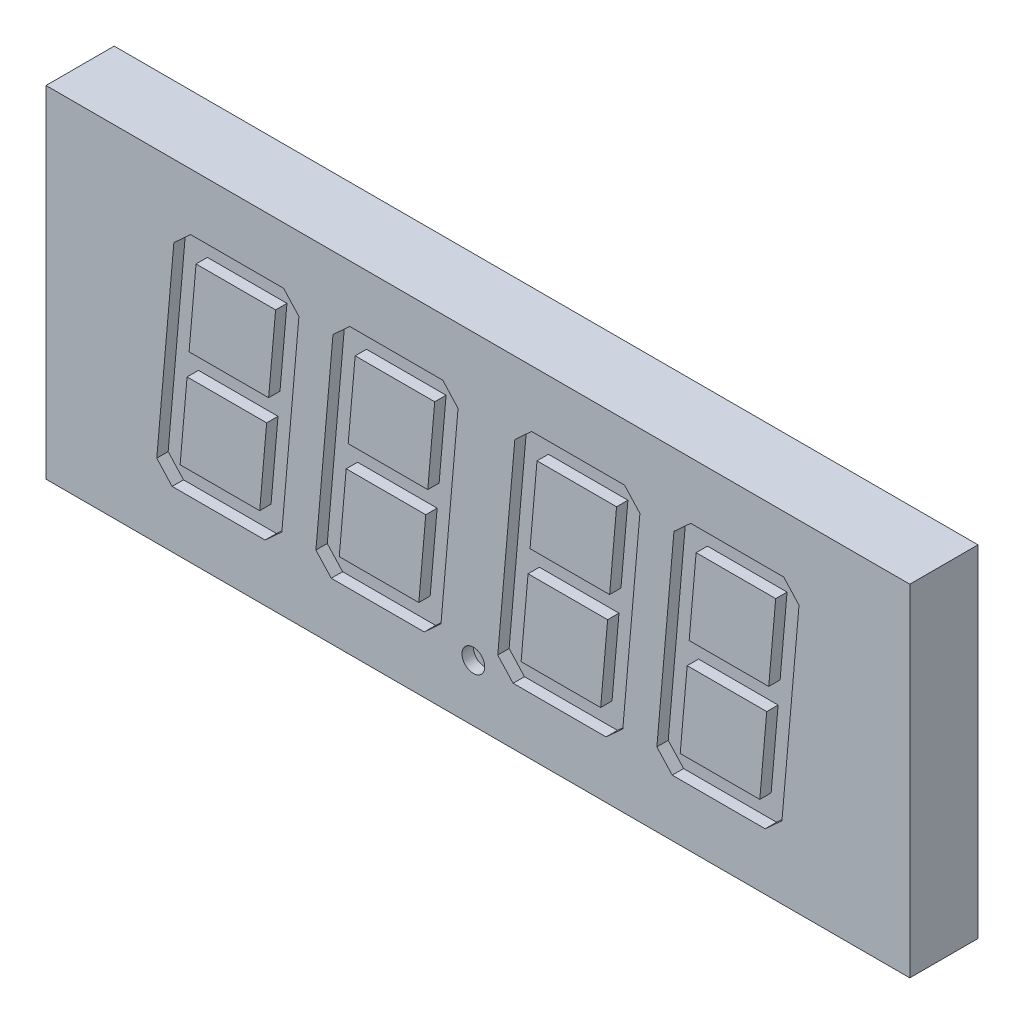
from build123d import *

# Parameters (mm, degrees)
BR_U_H_W             = 38
BR_U_H_H             = 15
AUFSATZ_LIN_GK_DEPTH = 3
SCHNITT_LIN_A_DEPTH  = 0.5
KREISMUSTER_A_COUNT  = 2
SCHNITT_LIN_B_DEPTH  = 0.5
KREISMUSTER_B_COUNT  = 2
SCHNITT_LIN_C_DEPTH  = 0.5
KREISMUSTER_C_COUNT  = 2
SCHNITT_LIN_D_DEPTH  = 0.5
KREISMUSTER_D_COUNT  = 2
PU_R                 = 0.5
SCHNITT_LIN_PU_DEPTH = 0.5


with BuildPart() as part:
    # Br u H → Aufsatz-Lin_GK (new body)
    with BuildSketch(Plane.XY):
        with Locations((4, 0)):
            Rectangle(BR_U_H_W, BR_U_H_H)
    extrude(amount=-AUFSATZ_LIN_GK_DEPTH)

    # Sketch A → Schnitt-Lin_A (cut)
    with BuildSketch(Plane.XY):
        Polygon((-10.126759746, -4.262722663), (-9.753819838, 0), (-4.246180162, 0), (-4.624516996, -4.324409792), (-5.361794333, -5), (-9.451169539, -5), align=None)
        Polygon((-8.793744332, -0.5), (-5.293744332, -0.5), (-5.599954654, -4), (-9.099954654, -4), align=None, mode=Mode.SUBTRACT)
    schnitt_lin_a = extrude(amount=-SCHNITT_LIN_A_DEPTH, mode=Mode.SUBTRACT)

    # Kreismuster_A: Schnitt-Lin_A ×2 about axis
    kreismuster_a_axis = Axis((-7, 0, 0), (0, 0, 1))
    for i in range(1, KREISMUSTER_A_COUNT):
        add(schnitt_lin_a.rotate(kreismuster_a_axis, i * 360 / KREISMUSTER_A_COUNT), mode=Mode.SUBTRACT)

    # Sketch B → Schnitt-Lin_B (cut)
    with BuildSketch(Plane.XY):
        Polygon((-3.126759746, -4.262722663), (-2.753819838, 0), (2.753819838, 0), (2.375483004, -4.324409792), (1.638205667, -5), (-2.451169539, -5), align=None)
        Polygon((-1.793744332, -0.5), (1.706255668, -0.5), (1.400045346, -4), (-2.099954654, -4), align=None, mode=Mode.SUBTRACT)
    schnitt_lin_b = extrude(amount=-SCHNITT_LIN_B_DEPTH, mode=Mode.SUBTRACT)

    # Kreismuster_B: Schnitt-Lin_B ×2 about axis
    kreismuster_b_axis = Axis((0, 0, 0), (0, 0, 1))
    for i in range(1, KREISMUSTER_B_COUNT):
        add(schnitt_lin_b.rotate(kreismuster_b_axis, i * 360 / KREISMUSTER_B_COUNT), mode=Mode.SUBTRACT)

    # Sketch C → Schnitt-Lin_C (cut)
    with BuildSketch(Plane.XY):
        Polygon((4.873240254, -4.262722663), (5.246180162, 0), (10.753819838, 0), (10.375483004, -4.324409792), (9.638205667, -5), (5.548830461, -5), align=None)
        Polygon((6.206255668, -0.5), (9.706255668, -0.5), (9.400045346, -4), (5.900045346, -4), align=None, mode=Mode.SUBTRACT)
    schnitt_lin_c = extrude(amount=-SCHNITT_LIN_C_DEPTH, mode=Mode.SUBTRACT)

    # Kreismuster_C: Schnitt-Lin_C ×2 about axis
    kreismuster_c_axis = Axis((8, 0, 0), (0, 0, 1))
    for i in range(1, KREISMUSTER_C_COUNT):
        add(schnitt_lin_c.rotate(kreismuster_c_axis, i * 360 / KREISMUSTER_C_COUNT), mode=Mode.SUBTRACT)

    # Sketch D → Schnitt-Lin_D (cut)
    with BuildSketch(Plane.XY):
        Polygon((11.873240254, -4.262722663), (12.246180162, 0), (17.753819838, 0), (17.375483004, -4.324409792), (16.638205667, -5), (12.548830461, -5), align=None)
        Polygon((13.206255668, -0.5), (16.706255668, -0.5), (16.400045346, -4), (12.900045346, -4), align=None, mode=Mode.SUBTRACT)
    schnitt_lin_d = extrude(amount=-SCHNITT_LIN_D_DEPTH, mode=Mode.SUBTRACT)

    # Kreismuster_D: Schnitt-Lin_D ×2 about axis
    kreismuster_d_axis = Axis((15, 0, 0), (0, 0, 1))
    for i in range(1, KREISMUSTER_D_COUNT):
        add(schnitt_lin_d.rotate(kreismuster_d_axis, i * 360 / KREISMUSTER_D_COUNT), mode=Mode.SUBTRACT)

    # Pu → Schnitt-Lin_Pu (cut)
    with BuildSketch(Plane.XY):
        with Locations((3.8, -5)):
            Circle(PU_R)
    extrude(amount=-SCHNITT_LIN_PU_DEPTH, mode=Mode.SUBTRACT)


solid = part.part
